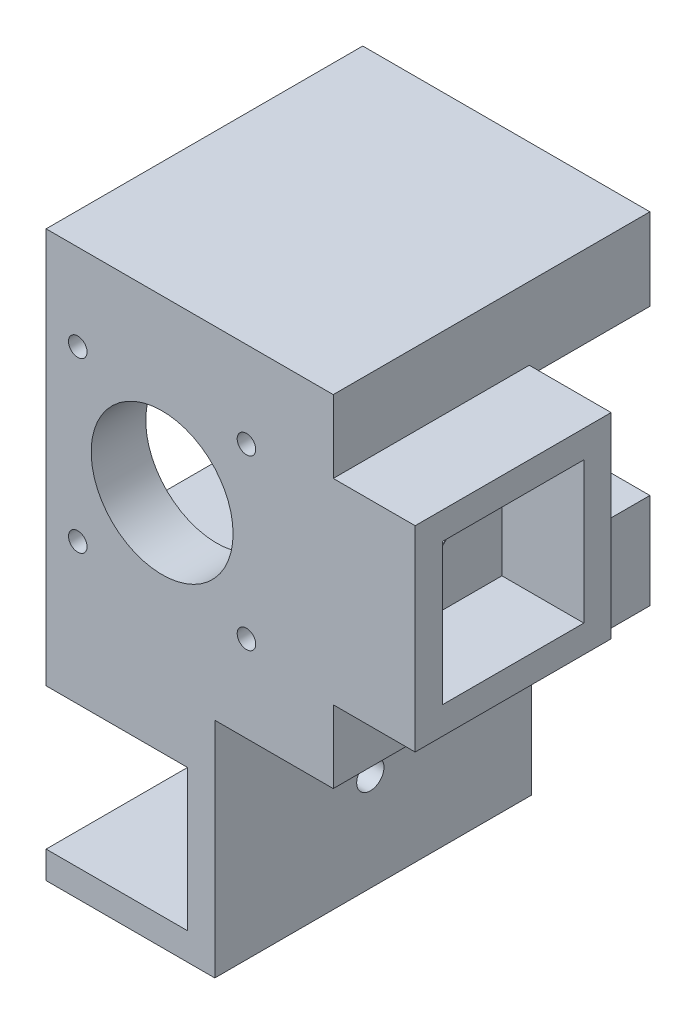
from build123d import *

# Parameters (mm, degrees)
SKETCH2_W            = 62.5
SKETCH2_H            = 62.5
SKETCH2_W_2          = 42.5
SKETCH2_H_2          = 42.5
BOSS_EXTRUDE2_DEPTH  = 48
SKETCH3_W            = 62.5
SKETCH3_H            = 62.5
SKETCH3_R            = 13
BOSS_EXTRUDE3_DEPTH  = 10
SKETCH15_W           = 58
SKETCH15_H           = 62.5
BOSS_EXTRUDE8_DEPTH  = 0.1
SKETCH16_W           = 35.9
SKETCH16_H           = 35.9
SKETCH16_W_2         = 25.9
SKETCH16_H_2         = 25.9
BOSS_EXTRUDE9_DEPTH  = 20
SKETCH17_R           = 3.43
CUT_EXTRUDE2_DEPTH   = 10
SKETCH18_R           = 7
CUT_EXTRUDE3_DEPTH   = 10
SKETCH19_R           = 1.7
CUT_EXTRUDE4_DEPTH   = 10
SKETCH35_W           = 22.1
SKETCH35_H           = 30
CUT_EXTRUDE11_DEPTH  = 85.848821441
SKETCH42_W           = 5
SKETCH42_H           = 35.9
CUT_EXTRUDE17_DEPTH  = 86.798965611
SKETCH49_W           = 30.9
SKETCH49_H           = 58
BOSS_EXTRUDE14_DEPTH = 40.9
SKETCH51_W           = 25.9
SKETCH51_H           = 25.9
CUT_EXTRUDE19_DEPTH  = 104.527508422
SKETCH52_W           = 10
SKETCH52_H           = 62.5
CUT_EXTRUDE20_DEPTH  = 104.527508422
SKETCH53_R           = 2.5
CUT_EXTRUDE21_DEPTH  = 95.109045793
SKETCH54_R           = 2.5
CUT_EXTRUDE22_DEPTH  = 20.9


with BuildPart() as part:
    # Sketch2 → Boss-Extrude2 (new body)
    with BuildSketch(Plane.XY):
        Rectangle(SKETCH2_W, SKETCH2_H)
        Rectangle(SKETCH2_W_2, SKETCH2_H_2, mode=Mode.SUBTRACT)
    extrude(amount=-BOSS_EXTRUDE2_DEPTH)

    # Sketch3 → Boss-Extrude3 (add)
    with BuildSketch(Plane.XY):
        Rectangle(SKETCH3_W, SKETCH3_H)
        Circle(SKETCH3_R, mode=Mode.SUBTRACT)
    extrude(amount=BOSS_EXTRUDE3_DEPTH)

    # Sketch15 → Boss-Extrude8 (add)
    with BuildSketch(Plane(origin=(31.25, 0, 0), x_dir=(0, 0, -1), z_dir=(1, 0, 0))):
        with Locations((19, 0)):
            Rectangle(SKETCH15_W, SKETCH15_H)
    extrude(amount=BOSS_EXTRUDE8_DEPTH)

    # Sketch16 → Boss-Extrude9 (add)
    with BuildSketch(Plane(origin=(31.35, 0, 0), x_dir=(0, 0, -1), z_dir=(1, 0, 0))):
        with Locations((7.95, 0)):
            Rectangle(SKETCH16_W, SKETCH16_H)
        with Locations((7.95, 0)):
            Rectangle(SKETCH16_W_2, SKETCH16_H_2, mode=Mode.SUBTRACT)
    extrude(amount=BOSS_EXTRUDE9_DEPTH)

    # Sketch17 → Cut-Extrude2 (cut)
    with BuildSketch(Plane(origin=(31.35, 0, 0), x_dir=(0, 0, -1), z_dir=(1, 0, 0))):
        with Locations((7.95, 0)):
            Circle(SKETCH17_R)
    extrude(amount=-CUT_EXTRUDE2_DEPTH, mode=Mode.SUBTRACT)

    # Sketch18 → Cut-Extrude3 (cut)
    with BuildSketch(Plane.ZY.offset(-21.25)):
        with Locations((-7.95, 0)):
            Circle(SKETCH18_R)
    extrude(amount=-CUT_EXTRUDE3_DEPTH, mode=Mode.SUBTRACT)

    # Sketch19 → Cut-Extrude4 (cut)
    with BuildSketch(Plane.XY.offset(10)):
        with Locations((-15.45, 15.45)):
            Circle(SKETCH19_R)
        with Locations((15.45, 15.45)):
            Circle(SKETCH19_R)
        with Locations((15.45, -15.45)):
            Circle(SKETCH19_R)
        with Locations((-15.45, -15.45)):
            Circle(SKETCH19_R)
    extrude(amount=-CUT_EXTRUDE4_DEPTH, mode=Mode.SUBTRACT)

    # Sketch35 → Cut-Extrude11 (cut, through all)
    with BuildSketch(Plane(origin=(31.35, 0, 0), x_dir=(0, 0, -1), z_dir=(1, 0, 0))):
        with Locations((36.95, 1.25)):
            Rectangle(SKETCH35_W, SKETCH35_H)
    extrude(amount=-CUT_EXTRUDE11_DEPTH, mode=Mode.SUBTRACT)

    # Sketch42 → Cut-Extrude17 (cut, through all)
    with BuildSketch(Plane(origin=(0, 17.95, 0), x_dir=(1, 0, 0), z_dir=(0, 1, 0))):
        with Locations((48.85, 7.95)):
            Rectangle(SKETCH42_W, SKETCH42_H)
    extrude(amount=-CUT_EXTRUDE17_DEPTH, mode=Mode.SUBTRACT)

    # Sketch49 → Boss-Extrude14 (add)
    with BuildSketch(Plane.XZ.offset(31.25)):
        with Locations((-5.8, -19)):
            Rectangle(SKETCH49_W, SKETCH49_H)
    extrude(amount=BOSS_EXTRUDE14_DEPTH)

    # Sketch51 → Cut-Extrude19 (cut, through all)
    with BuildSketch(Plane.XY.offset(10)):
        with Locations((-8.3, -54.2)):
            Rectangle(SKETCH51_W, SKETCH51_H)
    extrude(amount=-CUT_EXTRUDE19_DEPTH, mode=Mode.SUBTRACT)

    # Sketch52 → Cut-Extrude20 (cut, through all)
    with BuildSketch(Plane.XY.offset(10)):
        with Locations((-26.25, 0)):
            Rectangle(SKETCH52_W, SKETCH52_H)
    extrude(amount=-CUT_EXTRUDE20_DEPTH, mode=Mode.SUBTRACT)

    # Sketch53 → Cut-Extrude21 (cut, through all)
    with BuildSketch(Plane(origin=(9.65, 0, 0), x_dir=(0, 0, -1), z_dir=(1, 0, 0))):
        with Locations((18.493228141, -54.2)):
            Circle(SKETCH53_R)
    extrude(amount=-CUT_EXTRUDE21_DEPTH, mode=Mode.SUBTRACT)

    # Sketch54 → Cut-Extrude22 (cut)
    with BuildSketch(Plane.XZ.offset(72.15)):
        with Locations(Location((-8.3, -19, 0), (0, 0, 270))):
            Circle(SKETCH54_R)
    extrude(amount=-CUT_EXTRUDE22_DEPTH, mode=Mode.SUBTRACT)


solid = part.part
